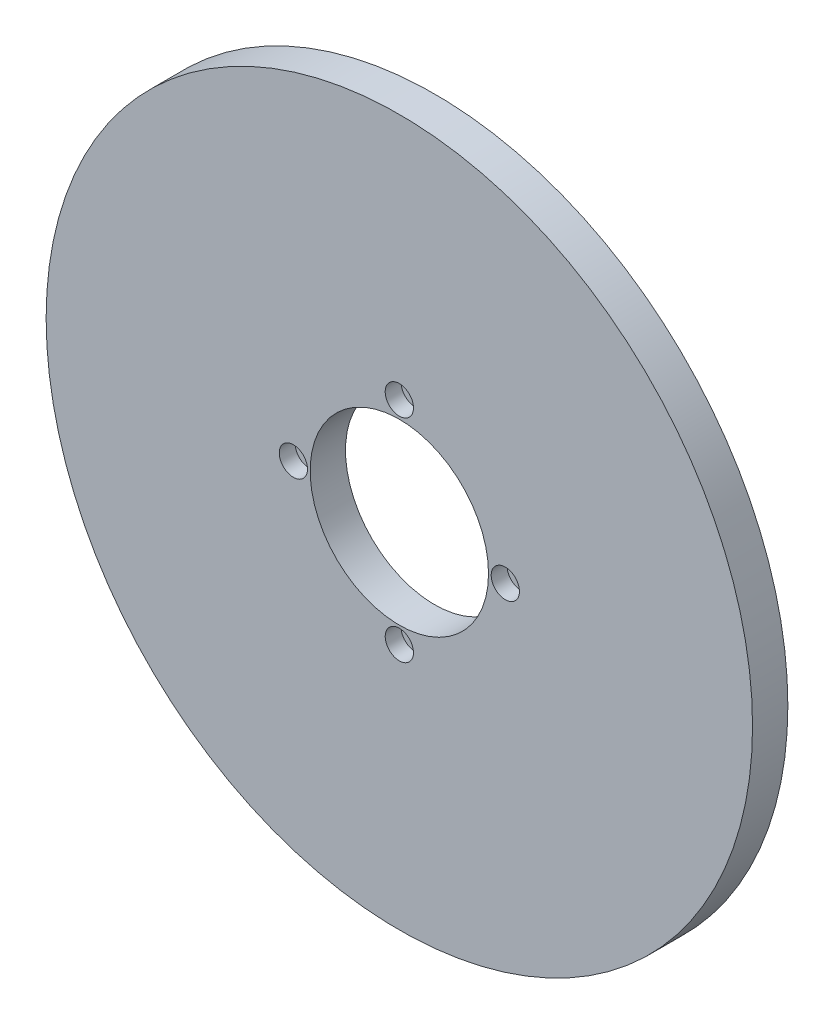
from build123d import *

# Parameters (mm, degrees)
SKETCH_1_R          = 100
SKETCH_1_R_2        = 25.25
SKETCH_1_R_3        = 2.25
EXTRUDE_1_DEPTH     = 10
SKETCH_2_R          = 4
CUT_EXTRUDE_1_DEPTH = 4.5


with BuildPart() as part:
    # Sketch 1 → Extrude 1 (new body)
    with BuildSketch(Plane.XY):
        Circle(SKETCH_1_R)
        Circle(SKETCH_1_R_2, mode=Mode.SUBTRACT)
        with Locations((30, 0)):
            Circle(SKETCH_1_R_3, mode=Mode.SUBTRACT)
        with Locations((0, 30)):
            Circle(SKETCH_1_R_3, mode=Mode.SUBTRACT)
        with Locations((-30, 0)):
            Circle(SKETCH_1_R_3, mode=Mode.SUBTRACT)
        with Locations((0, -30)):
            Circle(SKETCH_1_R_3, mode=Mode.SUBTRACT)
    extrude(amount=EXTRUDE_1_DEPTH)

    # Sketch 2 → Cut-Extrude 1 (cut)
    with BuildSketch(Plane.XY.offset(10)):
        with Locations((30, 0)):
            Circle(SKETCH_2_R)
        with Locations((0, 30)):
            Circle(SKETCH_2_R)
        with Locations((-30, 0)):
            Circle(SKETCH_2_R)
        with Locations((0, -30)):
            Circle(SKETCH_2_R)
    extrude(amount=-CUT_EXTRUDE_1_DEPTH, mode=Mode.SUBTRACT)


solid = part.part
